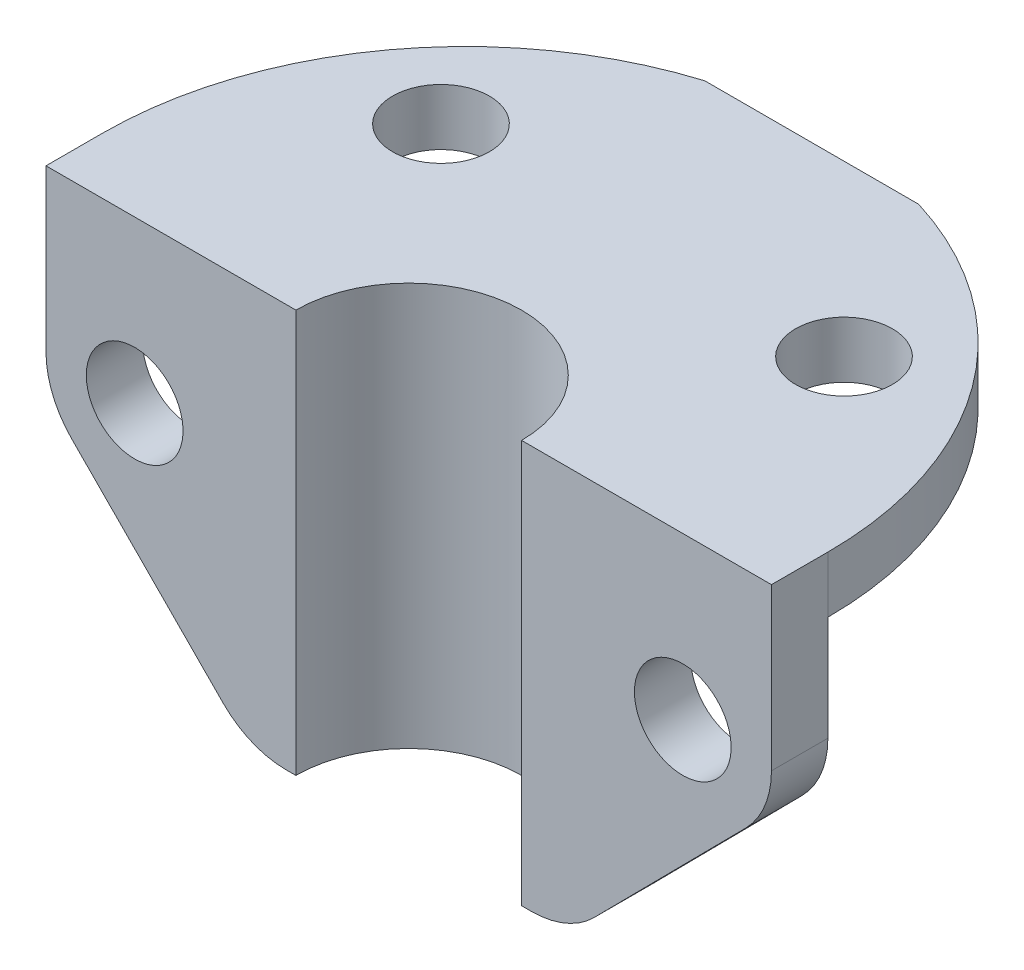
ISO-10303-21;
HEADER;
FILE_DESCRIPTION(('STEP AP214'),'2;1');
FILE_NAME('part.step','',(''),(''),'','','');
FILE_SCHEMA(('AUTOMOTIVE_DESIGN { 1 0 10303 214 1 1 1 1 }'));
ENDSEC;
DATA;
#1=APPLICATION_CONTEXT('core data for automotive mechanical design processes');
#2=APPLICATION_PROTOCOL_DEFINITION('international standard','automotive_design',2000,#1);
#3=PRODUCT_CONTEXT('',#1,'mechanical');
#4=PRODUCT('Part','Part','',(#3));
#5=PRODUCT_RELATED_PRODUCT_CATEGORY('part','',(#4));
#6=PRODUCT_DEFINITION_FORMATION('','',#4);
#7=PRODUCT_DEFINITION_CONTEXT('part definition',#1,'design');
#8=PRODUCT_DEFINITION('design','',#6,#7);
#9=PRODUCT_DEFINITION_SHAPE('','',#8);
#10=(LENGTH_UNIT() NAMED_UNIT(*) SI_UNIT(.MILLI.,.METRE.));
#11=(NAMED_UNIT(*) PLANE_ANGLE_UNIT() SI_UNIT($,.RADIAN.));
#12=(NAMED_UNIT(*) SI_UNIT($,.STERADIAN.) SOLID_ANGLE_UNIT());
#13=UNCERTAINTY_MEASURE_WITH_UNIT(LENGTH_MEASURE(1.E-05),#10,'distance_accuracy_value','');
#14=(GEOMETRIC_REPRESENTATION_CONTEXT(3) GLOBAL_UNCERTAINTY_ASSIGNED_CONTEXT((#13)) GLOBAL_UNIT_ASSIGNED_CONTEXT((#10,
#11,#12)) REPRESENTATION_CONTEXT('',''));
#15=CARTESIAN_POINT('',(0.,0.,0.));
#16=DIRECTION('',(0.,0.,1.));
#17=DIRECTION('',(1.,0.,0.));
#18=AXIS2_PLACEMENT_3D('',#15,#16,#17);
#19=CARTESIAN_POINT('',(45.,43.,0.));
#20=DIRECTION('',(0.,1.,0.));
#21=DIRECTION('',(0.,0.,1.));
#22=AXIS2_PLACEMENT_3D('',#19,#20,#21);
#23=CYLINDRICAL_SURFACE('',#22,45.);
#24=DIRECTION('',(0.,1.,0.));
#25=VECTOR('',#24,1.);
#26=CARTESIAN_POINT('',(58.2664991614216,43.,-43.));
#27=LINE('',#26,#25);
#28=CARTESIAN_POINT('',(58.2664991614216,50.,-43.));
#29=VERTEX_POINT('',#28);
#30=CARTESIAN_POINT('',(58.2664991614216,43.,-43.));
#31=VERTEX_POINT('',#30);
#32=EDGE_CURVE('E64',#29,#31,#27,.F.);
#33=ORIENTED_EDGE('',*,*,#32,.F.);
#34=CARTESIAN_POINT('',(45.,50.,0.));
#35=DIRECTION('',(0.,1.,0.));
#36=DIRECTION('',(0.,0.,1.));
#37=AXIS2_PLACEMENT_3D('',#34,#35,#36);
#38=CIRCLE('',#37,45.);
#39=CARTESIAN_POINT('',(90.,50.,0.));
#40=VERTEX_POINT('',#39);
#41=EDGE_CURVE('E180',#40,#29,#38,.T.);
#42=ORIENTED_EDGE('',*,*,#41,.F.);
#43=DIRECTION('',(0.,-1.,0.));
#44=VECTOR('',#43,1.);
#45=CARTESIAN_POINT('',(90.,50.,0.));
#46=LINE('',#45,#44);
#47=CARTESIAN_POINT('',(90.,43.,0.));
#48=VERTEX_POINT('',#47);
#49=EDGE_CURVE('E300',#40,#48,#46,.T.);
#50=ORIENTED_EDGE('',*,*,#49,.T.);
#51=CARTESIAN_POINT('',(45.,43.,0.));
#52=DIRECTION('',(0.,1.,0.));
#53=DIRECTION('',(0.,0.,1.));
#54=AXIS2_PLACEMENT_3D('',#51,#52,#53);
#55=CIRCLE('',#54,45.);
#56=EDGE_CURVE('E428',#48,#31,#55,.T.);
#57=ORIENTED_EDGE('',*,*,#56,.T.);
#58=EDGE_LOOP('',(#33,#42,#50,#57));
#59=FACE_BOUND('',#58,.T.);
#60=ADVANCED_FACE('F47',(#59),#23,.T.);
#61=CARTESIAN_POINT('',(0.,50.,0.));
#62=DIRECTION('',(0.,0.,-1.));
#63=DIRECTION('',(-1.,0.,0.));
#64=AXIS2_PLACEMENT_3D('',#61,#62,#63);
#65=PLANE('',#64);
#66=CARTESIAN_POINT('',(11.,30.,0.));
#67=DIRECTION('',(0.,0.,-1.));
#68=DIRECTION('',(-1.,0.,0.));
#69=AXIS2_PLACEMENT_3D('',#66,#67,#68);
#70=CIRCLE('',#69,6.);
#71=CARTESIAN_POINT('',(5.,30.,0.));
#72=VERTEX_POINT('',#71);
#73=EDGE_CURVE('E238',#72,#72,#70,.T.);
#74=ORIENTED_EDGE('',*,*,#73,.F.);
#75=EDGE_LOOP('',(#74));
#76=FACE_BOUND('',#75,.T.);
#77=DIRECTION('',(0.,-1.,0.));
#78=VECTOR('',#77,1.);
#79=CARTESIAN_POINT('',(0.,50.,0.));
#80=LINE('',#79,#78);
#81=CARTESIAN_POINT('',(0.,43.,0.));
#82=VERTEX_POINT('',#81);
#83=CARTESIAN_POINT('',(0.,30.,0.));
#84=VERTEX_POINT('',#83);
#85=EDGE_CURVE('E290',#82,#84,#80,.T.);
#86=ORIENTED_EDGE('',*,*,#85,.F.);
#87=DIRECTION('',(-1.,0.,0.));
#88=VECTOR('',#87,1.);
#89=CARTESIAN_POINT('',(0.,43.,0.));
#90=LINE('',#89,#88);
#91=CARTESIAN_POINT('',(25.2010101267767,43.,0.));
#92=VERTEX_POINT('',#91);
#93=EDGE_CURVE('E195',#92,#82,#90,.T.);
#94=ORIENTED_EDGE('',*,*,#93,.F.);
#95=DIRECTION('',(0.,-1.,0.));
#96=VECTOR('',#95,1.);
#97=CARTESIAN_POINT('',(25.2010101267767,50.,0.));
#98=LINE('',#97,#96);
#99=CARTESIAN_POINT('',(25.2010101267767,1.00419886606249,0.));
#100=VERTEX_POINT('',#99);
#101=EDGE_CURVE('E293',#92,#100,#98,.T.);
#102=ORIENTED_EDGE('',*,*,#101,.T.);
#103=CARTESIAN_POINT('',(29.7927374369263,11.,0.));
#104=DIRECTION('',(0.,0.,-1.));
#105=DIRECTION('',(-1.,0.,0.));
#106=AXIS2_PLACEMENT_3D('',#103,#104,#105);
#107=CIRCLE('',#106,11.);
#108=CARTESIAN_POINT('',(21.9720234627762,3.26459872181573,0.));
#109=VERTEX_POINT('',#108);
#110=EDGE_CURVE('E363',#100,#109,#107,.T.);
#111=ORIENTED_EDGE('',*,*,#110,.T.);
#112=DIRECTION('',(-0.703218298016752,0.710973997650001,0.));
#113=VECTOR('',#112,1.);
#114=CARTESIAN_POINT('',(12.7387080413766,12.5997471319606,0.));
#115=LINE('',#114,#113);
#116=CARTESIAN_POINT('',(3.17928602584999,22.2645987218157,0.));
#117=VERTEX_POINT('',#116);
#118=EDGE_CURVE('E201',#109,#117,#115,.T.);
#119=ORIENTED_EDGE('',*,*,#118,.T.);
#120=CARTESIAN_POINT('',(11.,30.,0.));
#121=DIRECTION('',(0.,0.,-1.));
#122=DIRECTION('',(-1.,0.,0.));
#123=AXIS2_PLACEMENT_3D('',#120,#121,#122);
#124=CIRCLE('',#123,11.);
#125=EDGE_CURVE('E197',#117,#84,#124,.T.);
#126=ORIENTED_EDGE('',*,*,#125,.T.);
#127=EDGE_LOOP('',(#86,#94,#102,#111,#119,#126));
#128=FACE_BOUND('',#127,.T.);
#129=ADVANCED_FACE('F349',(#76,#128),#65,.T.);
#130=CARTESIAN_POINT('',(0.,50.,0.));
#131=DIRECTION('',(0.,0.,-1.));
#132=DIRECTION('',(-1.,0.,0.));
#133=AXIS2_PLACEMENT_3D('',#130,#131,#132);
#134=PLANE('',#133);
#135=CARTESIAN_POINT('',(79.,30.,0.));
#136=DIRECTION('',(0.,0.,-1.));
#137=DIRECTION('',(-1.,0.,0.));
#138=AXIS2_PLACEMENT_3D('',#135,#136,#137);
#139=CIRCLE('',#138,6.);
#140=CARTESIAN_POINT('',(73.,30.,0.));
#141=VERTEX_POINT('',#140);
#142=EDGE_CURVE('E237',#141,#141,#139,.T.);
#143=ORIENTED_EDGE('',*,*,#142,.F.);
#144=EDGE_LOOP('',(#143));
#145=FACE_BOUND('',#144,.T.);
#146=DIRECTION('',(0.,-1.,0.));
#147=VECTOR('',#146,1.);
#148=CARTESIAN_POINT('',(64.7989898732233,50.,0.));
#149=LINE('',#148,#147);
#150=CARTESIAN_POINT('',(64.7989898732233,43.,0.));
#151=VERTEX_POINT('',#150);
#152=CARTESIAN_POINT('',(64.7989898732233,1.00419886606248,0.));
#153=VERTEX_POINT('',#152);
#154=EDGE_CURVE('E296',#151,#153,#149,.T.);
#155=ORIENTED_EDGE('',*,*,#154,.F.);
#156=DIRECTION('',(-1.,0.,0.));
#157=VECTOR('',#156,1.);
#158=CARTESIAN_POINT('',(0.,43.,0.));
#159=LINE('',#158,#157);
#160=EDGE_CURVE('E191',#48,#151,#159,.T.);
#161=ORIENTED_EDGE('',*,*,#160,.F.);
#162=CARTESIAN_POINT('',(90.,30.,0.));
#163=VERTEX_POINT('',#162);
#164=EDGE_CURVE('E299',#48,#163,#46,.T.);
#165=ORIENTED_EDGE('',*,*,#164,.T.);
#166=CARTESIAN_POINT('',(79.,30.,0.));
#167=DIRECTION('',(0.,0.,-1.));
#168=DIRECTION('',(-1.,0.,0.));
#169=AXIS2_PLACEMENT_3D('',#166,#167,#168);
#170=CIRCLE('',#169,11.);
#171=CARTESIAN_POINT('',(86.82071397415,22.2645987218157,0.));
#172=VERTEX_POINT('',#171);
#173=EDGE_CURVE('E215',#163,#172,#170,.T.);
#174=ORIENTED_EDGE('',*,*,#173,.T.);
#175=DIRECTION('',(0.703218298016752,0.710973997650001,0.));
#176=VECTOR('',#175,1.);
#177=CARTESIAN_POINT('',(32.7548542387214,-32.3975460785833,0.));
#178=LINE('',#177,#176);
#179=CARTESIAN_POINT('',(68.0279765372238,3.26459872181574,0.));
#180=VERTEX_POINT('',#179);
#181=EDGE_CURVE('E219',#180,#172,#178,.T.);
#182=ORIENTED_EDGE('',*,*,#181,.F.);
#183=CARTESIAN_POINT('',(60.2072625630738,11.,0.));
#184=DIRECTION('',(0.,0.,-1.));
#185=DIRECTION('',(-1.,0.,0.));
#186=AXIS2_PLACEMENT_3D('',#183,#184,#185);
#187=CIRCLE('',#186,11.);
#188=EDGE_CURVE('E324',#180,#153,#187,.T.);
#189=ORIENTED_EDGE('',*,*,#188,.T.);
#190=EDGE_LOOP('',(#155,#161,#165,#174,#182,#189));
#191=FACE_BOUND('',#190,.T.);
#192=ADVANCED_FACE('F347',(#145,#191),#134,.T.);
#193=CARTESIAN_POINT('',(45.,50.,7.));
#194=DIRECTION('',(0.,-1.,0.));
#195=DIRECTION('',(0.,0.,-1.));
#196=AXIS2_PLACEMENT_3D('',#193,#194,#195);
#197=CYLINDRICAL_SURFACE('',#196,21.);
#198=CARTESIAN_POINT('',(45.,43.,7.));
#199=DIRECTION('',(0.,1.,0.));
#200=DIRECTION('',(0.,0.,1.));
#201=AXIS2_PLACEMENT_3D('',#198,#199,#200);
#202=CIRCLE('',#201,21.);
#203=EDGE_CURVE('E57',#151,#92,#202,.T.);
#204=ORIENTED_EDGE('',*,*,#203,.F.);
#205=ORIENTED_EDGE('',*,*,#154,.T.);
#206=CARTESIAN_POINT('',(64.7989898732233,1.00419886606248,0.));
#207=CARTESIAN_POINT('',(64.7006069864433,0.959011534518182,-0.278254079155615));
#208=CARTESIAN_POINT('',(64.5964283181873,0.912907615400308,-0.554263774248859));
#209=CARTESIAN_POINT('',(64.3765728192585,0.820062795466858,-1.10157163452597));
#210=CARTESIAN_POINT('',(64.2608954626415,0.773321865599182,-1.37286958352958));
#211=CARTESIAN_POINT('',(63.8963237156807,0.633773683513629,-2.18031166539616));
#212=CARTESIAN_POINT('',(63.6302518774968,0.541815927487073,-2.70897960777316));
#213=CARTESIAN_POINT('',(63.0596587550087,0.372179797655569,-3.7324149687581));
#214=CARTESIAN_POINT('',(62.7560796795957,0.294238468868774,-4.2276651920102));
#215=CARTESIAN_POINT('',(62.1076353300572,0.160351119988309,-5.19286804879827));
#216=CARTESIAN_POINT('',(61.7628259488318,0.104375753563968,-5.66285370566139));
#217=CARTESIAN_POINT('',(61.2105759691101,0.0442231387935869,-6.35319058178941));
#218=CARTESIAN_POINT('',(61.0175472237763,0.02808970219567,-6.58413753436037));
#219=CARTESIAN_POINT('',(60.6204138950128,0.0059547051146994,-7.03903063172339));
#220=CARTESIAN_POINT('',(60.4162545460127,8.99850743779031E-06,-7.26293161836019));
#221=CARTESIAN_POINT('',(60.2072625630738,0.,-7.48237429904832));
#222=B_SPLINE_CURVE_WITH_KNOTS('',3,(#206,#207,#208,#209,#210,#211,#212,#213,#214,#215,#216,
#217,#218,#219,#220,#221),.UNSPECIFIED.,.F.,.F.,(4,2,2,2,2,2,2,4),(0.,0.895572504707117,
1.79118599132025,3.58570444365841,5.34190878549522,7.09575880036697,7.9996333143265,
8.90844761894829),.UNSPECIFIED.);
#223=CARTESIAN_POINT('',(60.2072625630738,0.,-7.48237429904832));
#224=VERTEX_POINT('',#223);
#225=EDGE_CURVE('E328',#153,#224,#222,.T.);
#226=ORIENTED_EDGE('',*,*,#225,.T.);
#227=CARTESIAN_POINT('',(45.,0.,7.));
#228=DIRECTION('',(0.,1.,0.));
#229=DIRECTION('',(0.,0.,1.));
#230=AXIS2_PLACEMENT_3D('',#227,#228,#229);
#231=CIRCLE('',#230,21.);
#232=CARTESIAN_POINT('',(29.7927374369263,0.,-7.48237429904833));
#233=VERTEX_POINT('',#232);
#234=EDGE_CURVE('E277',#224,#233,#231,.T.);
#235=ORIENTED_EDGE('',*,*,#234,.T.);
#236=CARTESIAN_POINT('',(29.7927374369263,0.,-7.48237429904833));
#237=CARTESIAN_POINT('',(29.6306867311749,3.24013330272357E-06,-7.31221601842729));
#238=CARTESIAN_POINT('',(29.4715276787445,0.00358058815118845,-7.13936746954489));
#239=CARTESIAN_POINT('',(29.1592455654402,0.0171440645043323,-6.78860440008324));
#240=CARTESIAN_POINT('',(29.0061212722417,0.0271288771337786,-6.61069092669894));
#241=CARTESIAN_POINT('',(28.5564246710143,0.0655589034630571,-6.07013096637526));
#242=CARTESIAN_POINT('',(28.2691568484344,0.102483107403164,-5.70027429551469));
#243=CARTESIAN_POINT('',(27.7249932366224,0.192623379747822,-4.94931423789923));
#244=CARTESIAN_POINT('',(27.4677107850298,0.24559017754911,-4.56845839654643));
#245=CARTESIAN_POINT('',(26.9793360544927,0.362903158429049,-3.79194235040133));
#246=CARTESIAN_POINT('',(26.7482460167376,0.427250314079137,-3.39628088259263));
#247=CARTESIAN_POINT('',(26.40092525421,0.535104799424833,-2.7544167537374));
#248=CARTESIAN_POINT('',(26.2760421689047,0.576514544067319,-2.51248965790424));
#249=CARTESIAN_POINT('',(26.0358808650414,0.660647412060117,-2.02419976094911));
#250=CARTESIAN_POINT('',(25.9206003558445,0.703370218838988,-1.77783803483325));
#251=CARTESIAN_POINT('',(25.6987227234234,0.789547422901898,-1.27864592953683));
#252=CARTESIAN_POINT('',(25.592212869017,0.833004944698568,-1.02577732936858));
#253=CARTESIAN_POINT('',(25.389126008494,0.919307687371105,-0.515911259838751));
#254=CARTESIAN_POINT('',(25.2925512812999,0.962152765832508,-0.258912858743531));
#255=CARTESIAN_POINT('',(25.2010101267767,1.00419886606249,0.));
#256=B_SPLINE_CURVE_WITH_KNOTS('',3,(#236,#237,#238,#239,#240,#241,#242,#243,#244,#245,#246,
#247,#248,#249,#250,#251,#252,#253,#254,#255),.UNSPECIFIED.,.F.,.F.,(4,2,2,2,2,2,2,2,2,4),(0.,
0.704791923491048,1.40943917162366,2.81712097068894,4.20396396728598,5.59092554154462,
6.41691461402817,7.24270608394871,8.07591283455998,8.90931028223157),.UNSPECIFIED.);
#257=EDGE_CURVE('E354',#233,#100,#256,.T.);
#258=ORIENTED_EDGE('',*,*,#257,.T.);
#259=ORIENTED_EDGE('',*,*,#101,.F.);
#260=EDGE_LOOP('',(#204,#205,#226,#235,#258,#259));
#261=FACE_BOUND('',#260,.T.);
#262=ADVANCED_FACE('F341',(#261),#197,.T.);
#263=CARTESIAN_POINT('',(0.,50.,0.));
#264=DIRECTION('',(1.,0.,0.));
#265=DIRECTION('',(0.,0.,-1.));
#266=AXIS2_PLACEMENT_3D('',#263,#264,#265);
#267=PLANE('',#266);
#268=DIRECTION('',(0.,0.,-1.));
#269=VECTOR('',#268,1.);
#270=CARTESIAN_POINT('',(0.,30.,43.));
#271=LINE('',#270,#269);
#272=CARTESIAN_POINT('',(0.,30.,7.));
#273=VERTEX_POINT('',#272);
#274=EDGE_CURVE('E205',#273,#84,#271,.T.);
#275=ORIENTED_EDGE('',*,*,#274,.F.);
#276=DIRECTION('',(0.,-1.,0.));
#277=VECTOR('',#276,1.);
#278=CARTESIAN_POINT('',(0.,50.,7.));
#279=LINE('',#278,#277);
#280=CARTESIAN_POINT('',(0.,50.,7.));
#281=VERTEX_POINT('',#280);
#282=EDGE_CURVE('E286',#281,#273,#279,.T.);
#283=ORIENTED_EDGE('',*,*,#282,.F.);
#284=DIRECTION('',(0.,0.,1.));
#285=VECTOR('',#284,1.);
#286=CARTESIAN_POINT('',(0.,50.,0.));
#287=LINE('',#286,#285);
#288=CARTESIAN_POINT('',(0.,50.,0.));
#289=VERTEX_POINT('',#288);
#290=EDGE_CURVE('E262',#289,#281,#287,.T.);
#291=ORIENTED_EDGE('',*,*,#290,.F.);
#292=EDGE_CURVE('E186',#289,#82,#80,.T.);
#293=ORIENTED_EDGE('',*,*,#292,.T.);
#294=ORIENTED_EDGE('',*,*,#85,.T.);
#295=EDGE_LOOP('',(#275,#283,#291,#293,#294));
#296=FACE_BOUND('',#295,.T.);
#297=ADVANCED_FACE('F346',(#296),#267,.F.);
#298=CARTESIAN_POINT('',(0.,50.,7.));
#299=DIRECTION('',(0.,0.,-1.));
#300=DIRECTION('',(-1.,0.,0.));
#301=AXIS2_PLACEMENT_3D('',#298,#299,#300);
#302=PLANE('',#301);
#303=CARTESIAN_POINT('',(11.,30.,7.));
#304=DIRECTION('',(0.,0.,-1.));
#305=DIRECTION('',(-1.,0.,0.));
#306=AXIS2_PLACEMENT_3D('',#303,#304,#305);
#307=CIRCLE('',#306,6.);
#308=CARTESIAN_POINT('',(5.,30.,7.));
#309=VERTEX_POINT('',#308);
#310=EDGE_CURVE('E242',#309,#309,#307,.T.);
#311=ORIENTED_EDGE('',*,*,#310,.T.);
#312=EDGE_LOOP('',(#311));
#313=FACE_BOUND('',#312,.T.);
#314=DIRECTION('',(-0.703218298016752,0.710973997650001,0.));
#315=VECTOR('',#314,1.);
#316=CARTESIAN_POINT('',(-12.2597881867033,37.8739483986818,7.));
#317=LINE('',#316,#315);
#318=CARTESIAN_POINT('',(21.9720234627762,3.26459872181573,7.));
#319=VERTEX_POINT('',#318);
#320=CARTESIAN_POINT('',(3.17928602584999,22.2645987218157,7.));
#321=VERTEX_POINT('',#320);
#322=EDGE_CURVE('E209',#319,#321,#317,.T.);
#323=ORIENTED_EDGE('',*,*,#322,.F.);
#324=CARTESIAN_POINT('',(29.7927374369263,11.,7.));
#325=DIRECTION('',(0.,0.,-1.));
#326=DIRECTION('',(-1.,0.,0.));
#327=AXIS2_PLACEMENT_3D('',#324,#325,#326);
#328=CIRCLE('',#327,11.);
#329=CARTESIAN_POINT('',(29.7927374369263,0.,7.));
#330=VERTEX_POINT('',#329);
#331=EDGE_CURVE('E393',#319,#330,#328,.F.);
#332=ORIENTED_EDGE('',*,*,#331,.T.);
#333=DIRECTION('',(1.,0.,0.));
#334=VECTOR('',#333,1.);
#335=CARTESIAN_POINT('',(0.,0.,7.));
#336=LINE('',#335,#334);
#337=CARTESIAN_POINT('',(31.,0.,7.));
#338=VERTEX_POINT('',#337);
#339=EDGE_CURVE('E255',#330,#338,#336,.T.);
#340=ORIENTED_EDGE('',*,*,#339,.T.);
#341=DIRECTION('',(0.,-1.,0.));
#342=VECTOR('',#341,1.);
#343=CARTESIAN_POINT('',(31.,50.,7.));
#344=LINE('',#343,#342);
#345=CARTESIAN_POINT('',(31.,50.,7.));
#346=VERTEX_POINT('',#345);
#347=EDGE_CURVE('E269',#346,#338,#344,.T.);
#348=ORIENTED_EDGE('',*,*,#347,.F.);
#349=DIRECTION('',(1.,0.,0.));
#350=VECTOR('',#349,1.);
#351=CARTESIAN_POINT('',(0.,50.,7.));
#352=LINE('',#351,#350);
#353=EDGE_CURVE('E265',#281,#346,#352,.T.);
#354=ORIENTED_EDGE('',*,*,#353,.F.);
#355=ORIENTED_EDGE('',*,*,#282,.T.);
#356=CARTESIAN_POINT('',(11.,30.,7.));
#357=DIRECTION('',(0.,0.,-1.));
#358=DIRECTION('',(-1.,0.,0.));
#359=AXIS2_PLACEMENT_3D('',#356,#357,#358);
#360=CIRCLE('',#359,11.);
#361=EDGE_CURVE('E336',#321,#273,#360,.T.);
#362=ORIENTED_EDGE('',*,*,#361,.F.);
#363=EDGE_LOOP('',(#323,#332,#340,#348,#354,#355,#362));
#364=FACE_BOUND('',#363,.T.);
#365=ADVANCED_FACE('F413',(#313,#364),#302,.F.);
#366=CARTESIAN_POINT('',(0.,0.,0.));
#367=DIRECTION('',(0.,1.,0.));
#368=DIRECTION('',(0.,0.,1.));
#369=AXIS2_PLACEMENT_3D('',#366,#367,#368);
#370=PLANE('',#369);
#371=ORIENTED_EDGE('',*,*,#339,.F.);
#372=DIRECTION('',(0.,0.,1.));
#373=VECTOR('',#372,1.);
#374=CARTESIAN_POINT('',(29.7927374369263,0.,0.));
#375=LINE('',#374,#373);
#376=EDGE_CURVE('E364',#330,#233,#375,.F.);
#377=ORIENTED_EDGE('',*,*,#376,.T.);
#378=ORIENTED_EDGE('',*,*,#234,.F.);
#379=DIRECTION('',(0.,0.,1.));
#380=VECTOR('',#379,1.);
#381=CARTESIAN_POINT('',(60.2072625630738,0.,0.));
#382=LINE('',#381,#380);
#383=CARTESIAN_POINT('',(60.2072625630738,0.,7.));
#384=VERTEX_POINT('',#383);
#385=EDGE_CURVE('E311',#224,#384,#382,.T.);
#386=ORIENTED_EDGE('',*,*,#385,.T.);
#387=DIRECTION('',(1.,0.,0.));
#388=VECTOR('',#387,1.);
#389=CARTESIAN_POINT('',(0.,0.,7.));
#390=LINE('',#389,#388);
#391=CARTESIAN_POINT('',(59.,0.,7.));
#392=VERTEX_POINT('',#391);
#393=EDGE_CURVE('E273',#392,#384,#390,.T.);
#394=ORIENTED_EDGE('',*,*,#393,.F.);
#395=CARTESIAN_POINT('',(45.,0.,7.));
#396=DIRECTION('',(0.,1.,0.));
#397=DIRECTION('',(0.,0.,1.));
#398=AXIS2_PLACEMENT_3D('',#395,#396,#397);
#399=CIRCLE('',#398,14.);
#400=EDGE_CURVE('E250',#392,#338,#399,.T.);
#401=ORIENTED_EDGE('',*,*,#400,.T.);
#402=EDGE_LOOP('',(#371,#377,#378,#386,#394,#401));
#403=FACE_BOUND('',#402,.T.);
#404=ADVANCED_FACE('F388',(#403),#370,.F.);
#405=CARTESIAN_POINT('',(0.,50.,7.));
#406=DIRECTION('',(0.,0.,-1.));
#407=DIRECTION('',(-1.,0.,0.));
#408=AXIS2_PLACEMENT_3D('',#405,#406,#407);
#409=PLANE('',#408);
#410=CARTESIAN_POINT('',(79.,30.,7.));
#411=DIRECTION('',(0.,0.,-1.));
#412=DIRECTION('',(-1.,0.,0.));
#413=AXIS2_PLACEMENT_3D('',#410,#411,#412);
#414=CIRCLE('',#413,6.);
#415=CARTESIAN_POINT('',(73.,30.,7.));
#416=VERTEX_POINT('',#415);
#417=EDGE_CURVE('E246',#416,#416,#414,.T.);
#418=ORIENTED_EDGE('',*,*,#417,.T.);
#419=EDGE_LOOP('',(#418));
#420=FACE_BOUND('',#419,.T.);
#421=ORIENTED_EDGE('',*,*,#393,.T.);
#422=CARTESIAN_POINT('',(60.2072625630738,11.,7.));
#423=DIRECTION('',(0.,0.,-1.));
#424=DIRECTION('',(-1.,0.,0.));
#425=AXIS2_PLACEMENT_3D('',#422,#423,#424);
#426=CIRCLE('',#425,11.);
#427=CARTESIAN_POINT('',(68.0279765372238,3.26459872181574,7.));
#428=VERTEX_POINT('',#427);
#429=EDGE_CURVE('E318',#384,#428,#426,.F.);
#430=ORIENTED_EDGE('',*,*,#429,.T.);
#431=DIRECTION('',(0.703218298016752,0.710973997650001,0.));
#432=VECTOR('',#431,1.);
#433=CARTESIAN_POINT('',(57.7533504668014,-7.12334481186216,7.));
#434=LINE('',#433,#432);
#435=CARTESIAN_POINT('',(86.82071397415,22.2645987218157,7.));
#436=VERTEX_POINT('',#435);
#437=EDGE_CURVE('E227',#428,#436,#434,.T.);
#438=ORIENTED_EDGE('',*,*,#437,.T.);
#439=CARTESIAN_POINT('',(79.,30.,7.));
#440=DIRECTION('',(0.,0.,-1.));
#441=DIRECTION('',(-1.,0.,0.));
#442=AXIS2_PLACEMENT_3D('',#439,#440,#441);
#443=CIRCLE('',#442,11.);
#444=CARTESIAN_POINT('',(90.,30.,7.));
#445=VERTEX_POINT('',#444);
#446=EDGE_CURVE('E233',#445,#436,#443,.T.);
#447=ORIENTED_EDGE('',*,*,#446,.F.);
#448=DIRECTION('',(0.,-1.,0.));
#449=VECTOR('',#448,1.);
#450=CARTESIAN_POINT('',(90.,50.,7.));
#451=LINE('',#450,#449);
#452=CARTESIAN_POINT('',(90.,50.,7.));
#453=VERTEX_POINT('',#452);
#454=EDGE_CURVE('E304',#453,#445,#451,.T.);
#455=ORIENTED_EDGE('',*,*,#454,.F.);
#456=DIRECTION('',(1.,0.,0.));
#457=VECTOR('',#456,1.);
#458=CARTESIAN_POINT('',(0.,50.,7.));
#459=LINE('',#458,#457);
#460=CARTESIAN_POINT('',(59.,50.,7.));
#461=VERTEX_POINT('',#460);
#462=EDGE_CURVE('E254',#461,#453,#459,.T.);
#463=ORIENTED_EDGE('',*,*,#462,.F.);
#464=DIRECTION('',(0.,-1.,0.));
#465=VECTOR('',#464,1.);
#466=CARTESIAN_POINT('',(59.,50.,7.));
#467=LINE('',#466,#465);
#468=EDGE_CURVE('E308',#461,#392,#467,.T.);
#469=ORIENTED_EDGE('',*,*,#468,.T.);
#470=EDGE_LOOP('',(#421,#430,#438,#447,#455,#463,#469));
#471=FACE_BOUND('',#470,.T.);
#472=ADVANCED_FACE('F422',(#420,#471),#409,.F.);
#473=CARTESIAN_POINT('',(90.,50.,0.));
#474=DIRECTION('',(1.,0.,0.));
#475=DIRECTION('',(0.,0.,-1.));
#476=AXIS2_PLACEMENT_3D('',#473,#474,#475);
#477=PLANE('',#476);
#478=ORIENTED_EDGE('',*,*,#454,.T.);
#479=DIRECTION('',(0.,0.,-1.));
#480=VECTOR('',#479,1.);
#481=CARTESIAN_POINT('',(90.,30.,43.));
#482=LINE('',#481,#480);
#483=EDGE_CURVE('E222',#445,#163,#482,.T.);
#484=ORIENTED_EDGE('',*,*,#483,.T.);
#485=ORIENTED_EDGE('',*,*,#164,.F.);
#486=ORIENTED_EDGE('',*,*,#49,.F.);
#487=DIRECTION('',(0.,0.,1.));
#488=VECTOR('',#487,1.);
#489=CARTESIAN_POINT('',(90.,50.,0.));
#490=LINE('',#489,#488);
#491=EDGE_CURVE('E258',#40,#453,#490,.T.);
#492=ORIENTED_EDGE('',*,*,#491,.T.);
#493=EDGE_LOOP('',(#478,#484,#485,#486,#492));
#494=FACE_BOUND('',#493,.T.);
#495=ADVANCED_FACE('F425',(#494),#477,.T.);
#496=CARTESIAN_POINT('',(45.,50.,7.));
#497=DIRECTION('',(0.,-1.,0.));
#498=DIRECTION('',(0.,0.,-1.));
#499=AXIS2_PLACEMENT_3D('',#496,#497,#498);
#500=CYLINDRICAL_SURFACE('',#499,14.);
#501=CARTESIAN_POINT('',(45.,50.,7.));
#502=DIRECTION('',(0.,1.,0.));
#503=DIRECTION('',(0.,0.,1.));
#504=AXIS2_PLACEMENT_3D('',#501,#502,#503);
#505=CIRCLE('',#504,14.);
#506=EDGE_CURVE('E251',#461,#346,#505,.T.);
#507=ORIENTED_EDGE('',*,*,#506,.T.);
#508=ORIENTED_EDGE('',*,*,#347,.T.);
#509=ORIENTED_EDGE('',*,*,#400,.F.);
#510=ORIENTED_EDGE('',*,*,#468,.F.);
#511=EDGE_LOOP('',(#507,#508,#509,#510));
#512=FACE_BOUND('',#511,.T.);
#513=ADVANCED_FACE('F419',(#512),#500,.F.);
#514=CARTESIAN_POINT('',(0.,50.,0.));
#515=DIRECTION('',(0.,1.,0.));
#516=DIRECTION('',(0.,0.,1.));
#517=AXIS2_PLACEMENT_3D('',#514,#515,#516);
#518=PLANE('',#517);
#519=CARTESIAN_POINT('',(20.,50.,-22.));
#520=DIRECTION('',(0.,-1.,0.));
#521=DIRECTION('',(0.,0.,-1.));
#522=AXIS2_PLACEMENT_3D('',#519,#520,#521);
#523=CIRCLE('',#522,5.99999999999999);
#524=CARTESIAN_POINT('',(20.,50.,-28.));
#525=VERTEX_POINT('',#524);
#526=EDGE_CURVE('E182',#525,#525,#523,.T.);
#527=ORIENTED_EDGE('',*,*,#526,.T.);
#528=EDGE_LOOP('',(#527));
#529=FACE_BOUND('',#528,.T.);
#530=CARTESIAN_POINT('',(70.,50.,-22.));
#531=DIRECTION('',(0.,-1.,0.));
#532=DIRECTION('',(0.,0.,-1.));
#533=AXIS2_PLACEMENT_3D('',#530,#531,#532);
#534=CIRCLE('',#533,6.);
#535=CARTESIAN_POINT('',(70.,50.,-28.));
#536=VERTEX_POINT('',#535);
#537=EDGE_CURVE('E435',#536,#536,#534,.T.);
#538=ORIENTED_EDGE('',*,*,#537,.T.);
#539=EDGE_LOOP('',(#538));
#540=FACE_BOUND('',#539,.T.);
#541=DIRECTION('',(1.,0.,0.));
#542=VECTOR('',#541,1.);
#543=CARTESIAN_POINT('',(0.,50.,-43.));
#544=LINE('',#543,#542);
#545=CARTESIAN_POINT('',(31.7335008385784,50.,-43.));
#546=VERTEX_POINT('',#545);
#547=EDGE_CURVE('E169',#546,#29,#544,.T.);
#548=ORIENTED_EDGE('',*,*,#547,.F.);
#549=EDGE_CURVE('E176',#546,#289,#38,.T.);
#550=ORIENTED_EDGE('',*,*,#549,.T.);
#551=ORIENTED_EDGE('',*,*,#290,.T.);
#552=ORIENTED_EDGE('',*,*,#353,.T.);
#553=ORIENTED_EDGE('',*,*,#506,.F.);
#554=ORIENTED_EDGE('',*,*,#462,.T.);
#555=ORIENTED_EDGE('',*,*,#491,.F.);
#556=ORIENTED_EDGE('',*,*,#41,.T.);
#557=EDGE_LOOP('',(#548,#550,#551,#552,#553,#554,#555,#556));
#558=FACE_BOUND('',#557,.T.);
#559=ADVANCED_FACE('F175',(#529,#540,#558),#518,.T.);
#560=CARTESIAN_POINT('',(11.,30.,43.));
#561=DIRECTION('',(0.,0.,-1.));
#562=DIRECTION('',(-1.,0.,0.));
#563=AXIS2_PLACEMENT_3D('',#560,#561,#562);
#564=CYLINDRICAL_SURFACE('',#563,6.);
#565=ORIENTED_EDGE('',*,*,#73,.T.);
#566=EDGE_LOOP('',(#565));
#567=FACE_BOUND('',#566,.T.);
#568=ORIENTED_EDGE('',*,*,#310,.F.);
#569=EDGE_LOOP('',(#568));
#570=FACE_BOUND('',#569,.T.);
#571=ADVANCED_FACE('F509',(#567,#570),#564,.F.);
#572=CARTESIAN_POINT('',(79.,30.,43.));
#573=DIRECTION('',(0.,0.,-1.));
#574=DIRECTION('',(-1.,0.,0.));
#575=AXIS2_PLACEMENT_3D('',#572,#573,#574);
#576=CYLINDRICAL_SURFACE('',#575,6.);
#577=ORIENTED_EDGE('',*,*,#142,.T.);
#578=EDGE_LOOP('',(#577));
#579=FACE_BOUND('',#578,.T.);
#580=ORIENTED_EDGE('',*,*,#417,.F.);
#581=EDGE_LOOP('',(#580));
#582=FACE_BOUND('',#581,.T.);
#583=ADVANCED_FACE('F505',(#579,#582),#576,.F.);
#584=CARTESIAN_POINT('',(79.,30.,43.));
#585=DIRECTION('',(0.,0.,-1.));
#586=DIRECTION('',(-1.,0.,0.));
#587=AXIS2_PLACEMENT_3D('',#584,#585,#586);
#588=CYLINDRICAL_SURFACE('',#587,11.);
#589=ORIENTED_EDGE('',*,*,#446,.T.);
#590=DIRECTION('',(0.,0.,-1.));
#591=VECTOR('',#590,1.);
#592=CARTESIAN_POINT('',(86.82071397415,22.2645987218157,43.));
#593=LINE('',#592,#591);
#594=EDGE_CURVE('E223',#436,#172,#593,.T.);
#595=ORIENTED_EDGE('',*,*,#594,.T.);
#596=ORIENTED_EDGE('',*,*,#173,.F.);
#597=ORIENTED_EDGE('',*,*,#483,.F.);
#598=EDGE_LOOP('',(#589,#595,#596,#597));
#599=FACE_BOUND('',#598,.T.);
#600=ADVANCED_FACE('F494',(#599),#588,.T.);
#601=CARTESIAN_POINT('',(32.7548542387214,-32.3975460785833,43.));
#602=DIRECTION('',(-0.710973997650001,0.703218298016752,0.));
#603=DIRECTION('',(-0.703218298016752,-0.710973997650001,0.));
#604=AXIS2_PLACEMENT_3D('',#601,#602,#603);
#605=PLANE('',#604);
#606=ORIENTED_EDGE('',*,*,#437,.F.);
#607=DIRECTION('',(0.,0.,1.));
#608=VECTOR('',#607,1.);
#609=CARTESIAN_POINT('',(68.0279765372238,3.26459872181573,43.));
#610=LINE('',#609,#608);
#611=EDGE_CURVE('E321',#428,#180,#610,.F.);
#612=ORIENTED_EDGE('',*,*,#611,.T.);
#613=ORIENTED_EDGE('',*,*,#181,.T.);
#614=ORIENTED_EDGE('',*,*,#594,.F.);
#615=EDGE_LOOP('',(#606,#612,#613,#614));
#616=FACE_BOUND('',#615,.T.);
#617=ADVANCED_FACE('F498',(#616),#605,.F.);
#618=CARTESIAN_POINT('',(60.2072625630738,11.,0.));
#619=DIRECTION('',(0.,0.,1.));
#620=DIRECTION('',(1.,0.,0.));
#621=AXIS2_PLACEMENT_3D('',#618,#619,#620);
#622=CYLINDRICAL_SURFACE('',#621,11.);
#623=ORIENTED_EDGE('',*,*,#188,.F.);
#624=ORIENTED_EDGE('',*,*,#611,.F.);
#625=ORIENTED_EDGE('',*,*,#429,.F.);
#626=ORIENTED_EDGE('',*,*,#385,.F.);
#627=ORIENTED_EDGE('',*,*,#225,.F.);
#628=EDGE_LOOP('',(#623,#624,#625,#626,#627));
#629=FACE_BOUND('',#628,.T.);
#630=ADVANCED_FACE('F338',(#629),#622,.T.);
#631=CARTESIAN_POINT('',(11.,30.,43.));
#632=DIRECTION('',(0.,0.,-1.));
#633=DIRECTION('',(-1.,0.,0.));
#634=AXIS2_PLACEMENT_3D('',#631,#632,#633);
#635=CYLINDRICAL_SURFACE('',#634,11.);
#636=ORIENTED_EDGE('',*,*,#361,.T.);
#637=ORIENTED_EDGE('',*,*,#274,.T.);
#638=ORIENTED_EDGE('',*,*,#125,.F.);
#639=DIRECTION('',(0.,0.,-1.));
#640=VECTOR('',#639,1.);
#641=CARTESIAN_POINT('',(3.17928602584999,22.2645987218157,43.));
#642=LINE('',#641,#640);
#643=EDGE_CURVE('E204',#321,#117,#642,.T.);
#644=ORIENTED_EDGE('',*,*,#643,.F.);
#645=EDGE_LOOP('',(#636,#637,#638,#644));
#646=FACE_BOUND('',#645,.T.);
#647=ADVANCED_FACE('F408',(#646),#635,.T.);
#648=CARTESIAN_POINT('',(12.7387080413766,12.5997471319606,43.));
#649=DIRECTION('',(-0.710973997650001,-0.703218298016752,0.));
#650=DIRECTION('',(0.703218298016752,-0.710973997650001,0.));
#651=AXIS2_PLACEMENT_3D('',#648,#649,#650);
#652=PLANE('',#651);
#653=ORIENTED_EDGE('',*,*,#118,.F.);
#654=DIRECTION('',(0.,0.,1.));
#655=VECTOR('',#654,1.);
#656=CARTESIAN_POINT('',(21.9720234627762,3.26459872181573,7.));
#657=LINE('',#656,#655);
#658=EDGE_CURVE('E395',#109,#319,#657,.T.);
#659=ORIENTED_EDGE('',*,*,#658,.T.);
#660=ORIENTED_EDGE('',*,*,#322,.T.);
#661=ORIENTED_EDGE('',*,*,#643,.T.);
#662=EDGE_LOOP('',(#653,#659,#660,#661));
#663=FACE_BOUND('',#662,.T.);
#664=ADVANCED_FACE('F484',(#663),#652,.T.);
#665=CARTESIAN_POINT('',(29.7927374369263,11.,43.));
#666=DIRECTION('',(0.,0.,-1.));
#667=DIRECTION('',(-1.,0.,0.));
#668=AXIS2_PLACEMENT_3D('',#665,#666,#667);
#669=CYLINDRICAL_SURFACE('',#668,11.);
#670=ORIENTED_EDGE('',*,*,#257,.F.);
#671=ORIENTED_EDGE('',*,*,#376,.F.);
#672=ORIENTED_EDGE('',*,*,#331,.F.);
#673=ORIENTED_EDGE('',*,*,#658,.F.);
#674=ORIENTED_EDGE('',*,*,#110,.F.);
#675=EDGE_LOOP('',(#670,#671,#672,#673,#674));
#676=FACE_BOUND('',#675,.T.);
#677=ADVANCED_FACE('F49',(#676),#669,.T.);
#678=DIRECTION('',(0.,1.,0.));
#679=VECTOR('',#678,1.);
#680=CARTESIAN_POINT('',(31.7335008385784,43.,-43.));
#681=LINE('',#680,#679);
#682=CARTESIAN_POINT('',(31.7335008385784,43.,-43.));
#683=VERTEX_POINT('',#682);
#684=EDGE_CURVE('E166',#683,#546,#681,.T.);
#685=ORIENTED_EDGE('',*,*,#684,.F.);
#686=EDGE_CURVE('E71',#683,#82,#55,.T.);
#687=ORIENTED_EDGE('',*,*,#686,.T.);
#688=ORIENTED_EDGE('',*,*,#292,.F.);
#689=ORIENTED_EDGE('',*,*,#549,.F.);
#690=EDGE_LOOP('',(#685,#687,#688,#689));
#691=FACE_BOUND('',#690,.T.);
#692=ADVANCED_FACE('F184',(#691),#23,.T.);
#693=CARTESIAN_POINT('',(0.,43.,0.));
#694=DIRECTION('',(0.,1.,0.));
#695=DIRECTION('',(0.,0.,1.));
#696=AXIS2_PLACEMENT_3D('',#693,#694,#695);
#697=PLANE('',#696);
#698=CARTESIAN_POINT('',(20.,43.,-22.));
#699=DIRECTION('',(0.,-1.,0.));
#700=DIRECTION('',(0.,0.,-1.));
#701=AXIS2_PLACEMENT_3D('',#698,#699,#700);
#702=CIRCLE('',#701,5.99999999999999);
#703=CARTESIAN_POINT('',(20.,43.,-28.));
#704=VERTEX_POINT('',#703);
#705=EDGE_CURVE('E443',#704,#704,#702,.T.);
#706=ORIENTED_EDGE('',*,*,#705,.F.);
#707=EDGE_LOOP('',(#706));
#708=FACE_BOUND('',#707,.T.);
#709=CARTESIAN_POINT('',(70.,43.,-22.));
#710=DIRECTION('',(0.,-1.,0.));
#711=DIRECTION('',(0.,0.,-1.));
#712=AXIS2_PLACEMENT_3D('',#709,#710,#711);
#713=CIRCLE('',#712,6.);
#714=CARTESIAN_POINT('',(70.,43.,-28.));
#715=VERTEX_POINT('',#714);
#716=EDGE_CURVE('E439',#715,#715,#713,.T.);
#717=ORIENTED_EDGE('',*,*,#716,.F.);
#718=EDGE_LOOP('',(#717));
#719=FACE_BOUND('',#718,.T.);
#720=ORIENTED_EDGE('',*,*,#686,.F.);
#721=DIRECTION('',(1.,0.,0.));
#722=VECTOR('',#721,1.);
#723=CARTESIAN_POINT('',(0.,43.,-43.));
#724=LINE('',#723,#722);
#725=EDGE_CURVE('E11',#683,#31,#724,.T.);
#726=ORIENTED_EDGE('',*,*,#725,.T.);
#727=ORIENTED_EDGE('',*,*,#56,.F.);
#728=ORIENTED_EDGE('',*,*,#160,.T.);
#729=ORIENTED_EDGE('',*,*,#203,.T.);
#730=ORIENTED_EDGE('',*,*,#93,.T.);
#731=EDGE_LOOP('',(#720,#726,#727,#728,#729,#730));
#732=FACE_BOUND('',#731,.T.);
#733=ADVANCED_FACE('F372',(#708,#719,#732),#697,.F.);
#734=CARTESIAN_POINT('',(0.,43.,-43.));
#735=DIRECTION('',(0.,0.,1.));
#736=DIRECTION('',(1.,0.,0.));
#737=AXIS2_PLACEMENT_3D('',#734,#735,#736);
#738=PLANE('',#737);
#739=ORIENTED_EDGE('',*,*,#32,.T.);
#740=ORIENTED_EDGE('',*,*,#725,.F.);
#741=ORIENTED_EDGE('',*,*,#684,.T.);
#742=ORIENTED_EDGE('',*,*,#547,.T.);
#743=EDGE_LOOP('',(#739,#740,#741,#742));
#744=FACE_BOUND('',#743,.T.);
#745=ADVANCED_FACE('F168',(#744),#738,.F.);
#746=CARTESIAN_POINT('',(70.,50.,-22.));
#747=DIRECTION('',(0.,-1.,0.));
#748=DIRECTION('',(0.,0.,-1.));
#749=AXIS2_PLACEMENT_3D('',#746,#747,#748);
#750=CYLINDRICAL_SURFACE('',#749,6.);
#751=ORIENTED_EDGE('',*,*,#537,.F.);
#752=EDGE_LOOP('',(#751));
#753=FACE_BOUND('',#752,.T.);
#754=ORIENTED_EDGE('',*,*,#716,.T.);
#755=EDGE_LOOP('',(#754));
#756=FACE_BOUND('',#755,.T.);
#757=ADVANCED_FACE('F456',(#753,#756),#750,.F.);
#758=CARTESIAN_POINT('',(20.,50.,-22.));
#759=DIRECTION('',(0.,-1.,0.));
#760=DIRECTION('',(0.,0.,-1.));
#761=AXIS2_PLACEMENT_3D('',#758,#759,#760);
#762=CYLINDRICAL_SURFACE('',#761,5.99999999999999);
#763=ORIENTED_EDGE('',*,*,#526,.F.);
#764=EDGE_LOOP('',(#763));
#765=FACE_BOUND('',#764,.T.);
#766=ORIENTED_EDGE('',*,*,#705,.T.);
#767=EDGE_LOOP('',(#766));
#768=FACE_BOUND('',#767,.T.);
#769=ADVANCED_FACE('F453',(#765,#768),#762,.F.);
#770=CLOSED_SHELL('',(#60,#129,#192,#262,#297,#365,#404,#472,#495,#513,#559,#571,#583,#600,#617,
#630,#647,#664,#677,#692,#733,#745,#757,#769));
#771=MANIFOLD_SOLID_BREP('B2',#770);
#772=ADVANCED_BREP_SHAPE_REPRESENTATION('',(#18,#771),#14);
#773=SHAPE_DEFINITION_REPRESENTATION(#9,#772);
ENDSEC;
END-ISO-10303-21;
